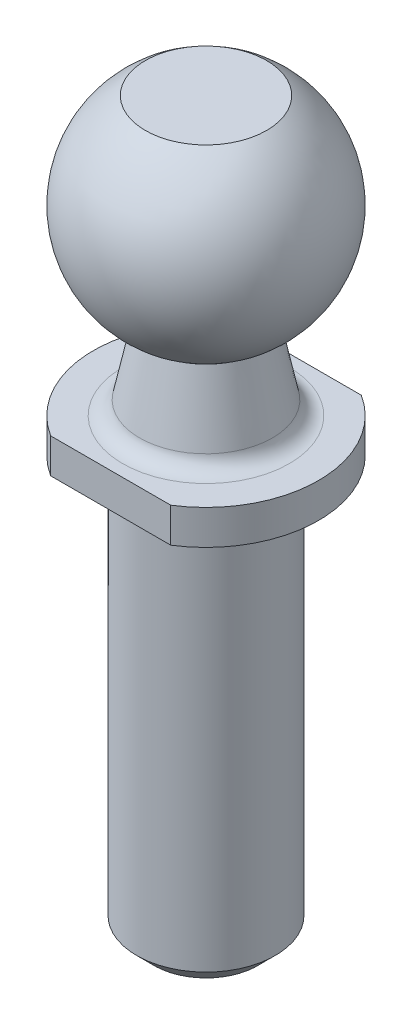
from build123d import *

# Parameters (mm, degrees)
CONG_1_R                = 1
CHANFREIN1_SIZE         = 1
ESQUISSE2_OUTSIDE_W     = 24.17
ESQUISSE2_OUTSIDE_H     = 24.17
ESQUISSE2_OUTSIDE_W_2   = 14.240179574
ESQUISSE2_OUTSIDE_H_2   = 11
ENL_V_MAT_EXTRU_1_DEPTH = 2


with BuildPart() as part:
    # Esquisse1 → Base-R_volution (revolve)
    with BuildSketch(Plane.XY):
        with BuildLine():
            Line((4, 0), (6.5, 0))
            Line((6.5, 0), (6.5, 2))
            Line((6.5, 2), (4, 2))
            Line((4, 2), (3, 6.756493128))
            ThreePointArc((3, 6.756493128), (6.493582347, 12.234004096), (3.5, 18))
            Line((3.5, 18), (0, 18))
            Line((0, 18), (0, -24))
            Line((0, -24), (4, -24))
            Line((4, -24), (4, 0))
        make_face()
    revolve(axis=Axis((0, 12.522774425, 0), (0, -1, 0)))

    # Cong_1
    cong_1_edges = [part.edges().sort_by_distance(p)[0] for p in [
        (-4, 2, 0),
    ]]
    fillet(cong_1_edges, radius=CONG_1_R)

    # Chanfrein1
    chanfrein1_edges = [part.edges().sort_by_distance(p)[0] for p in [
        (-4, -24, 0),
    ]]
    chamfer(chanfrein1_edges, length=CHANFREIN1_SIZE)

    # Esquisse2 outside → Enl_v. mat.-Extru.1 (cut)
    with BuildSketch(Plane.XZ):
        Rectangle(ESQUISSE2_OUTSIDE_W, ESQUISSE2_OUTSIDE_H)
        with Locations((-0.043771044, 0)):
            Rectangle(ESQUISSE2_OUTSIDE_W_2, ESQUISSE2_OUTSIDE_H_2, mode=Mode.SUBTRACT)
    extrude(amount=-ENL_V_MAT_EXTRU_1_DEPTH, mode=Mode.SUBTRACT)


solid = part.part
